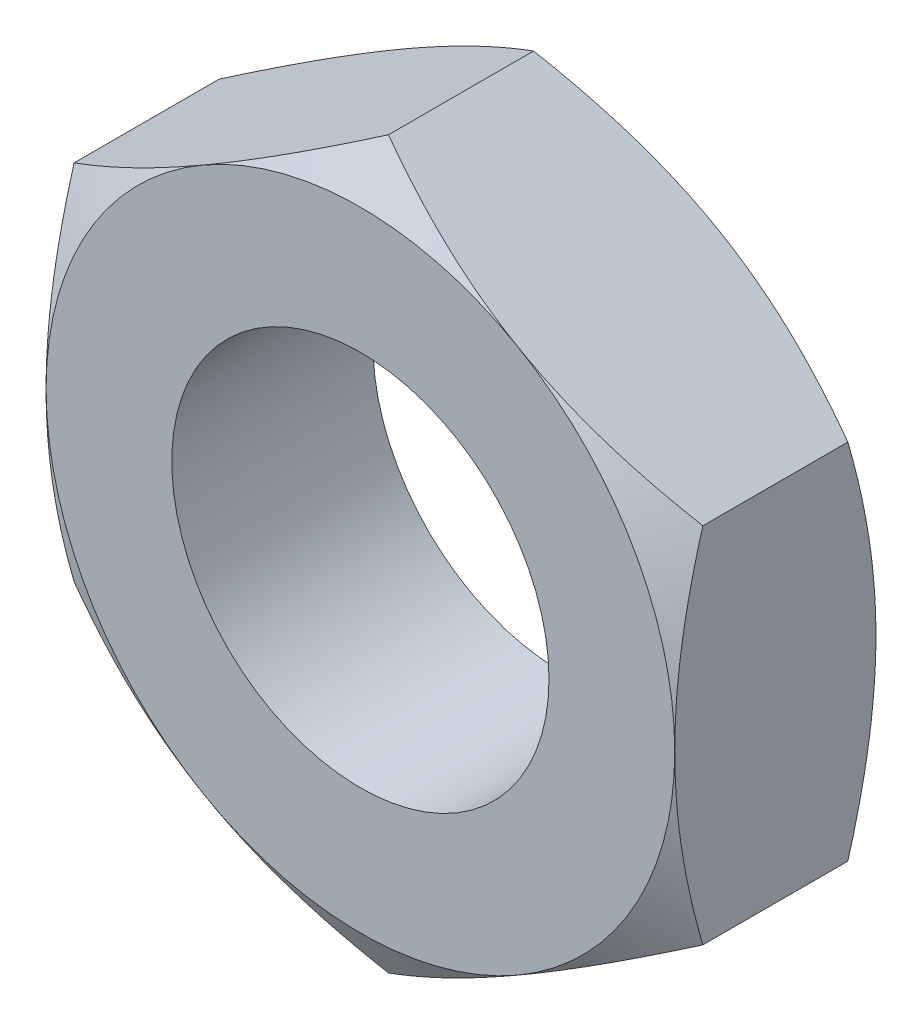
from build123d import *

# Parameters (mm, degrees)
BASE_EXTRUSION_DEPTH    = 3.2
ESQUISSE3_R             = 3
ENL_V_MAT_EXTRU_1_DEPTH = 9.280901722


with BuildPart() as part:
    # Esquisse1 → Base-Extrusion (new body)
    with BuildSketch(Plane.XY):
        Polygon((5, -2.886751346), (5, 2.886751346), (0, 5.773502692), (-5, 2.886751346), (-5, -2.886751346), (0, -5.773502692), align=None)
    extrude(amount=-BASE_EXTRUSION_DEPTH)

    # Esquisse2 → Enl_vement de mati_re-R_volution1 (revolve, cut)
    with BuildSketch(Plane(origin=(0, 0, 0), x_dir=(1, 0, 0), z_dir=(0, 1, 0))):
        Polygon((-5, 0), (-8.771281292, 0), (-8.771281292, 3.2), (-5, 3.2), (-7.771281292, 1.6), align=None)
    revolve(axis=Axis((0, 0, -3.2), (0, 0, 1)), mode=Mode.SUBTRACT)

    # Esquisse3 → Enl_v. mat.-Extru.1 (cut, through all)
    with BuildSketch(Plane.XY):
        Circle(ESQUISSE3_R)
    extrude(amount=-ENL_V_MAT_EXTRU_1_DEPTH, mode=Mode.SUBTRACT)


solid = part.part
